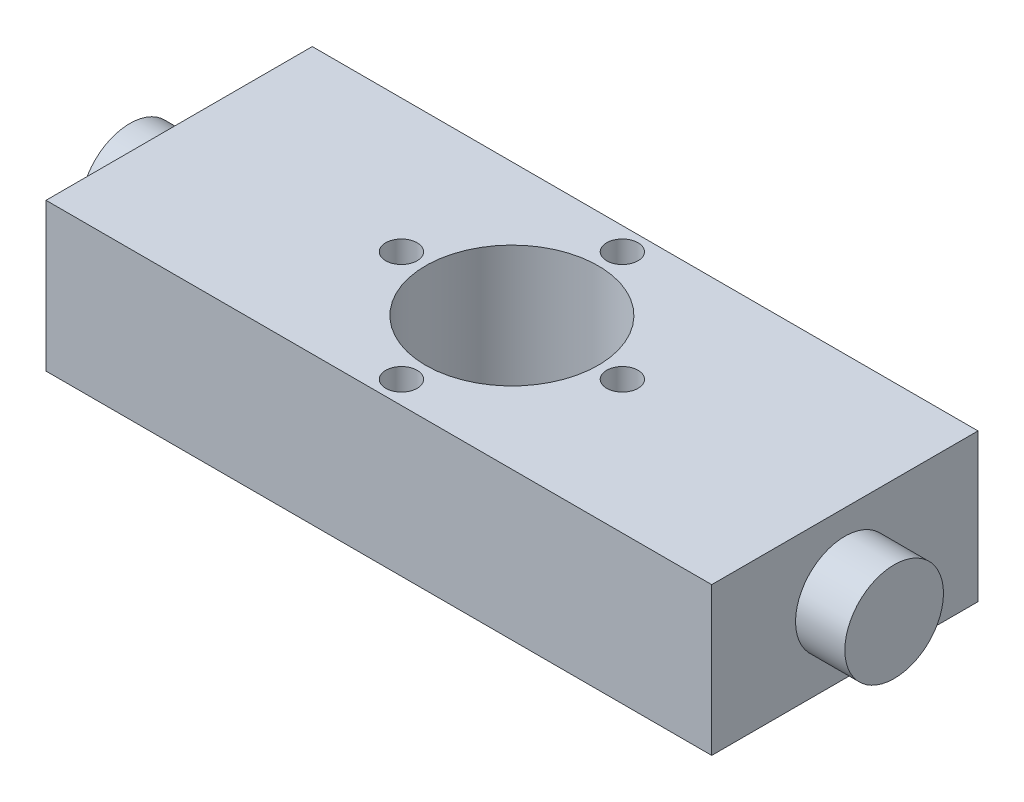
ISO-10303-21;
HEADER;
FILE_DESCRIPTION(('STEP AP214'),'2;1');
FILE_NAME('part.step','',(''),(''),'','','');
FILE_SCHEMA(('AUTOMOTIVE_DESIGN { 1 0 10303 214 1 1 1 1 }'));
ENDSEC;
DATA;
#1=APPLICATION_CONTEXT('core data for automotive mechanical design processes');
#2=APPLICATION_PROTOCOL_DEFINITION('international standard','automotive_design',2000,#1);
#3=PRODUCT_CONTEXT('',#1,'mechanical');
#4=PRODUCT('Part','Part','',(#3));
#5=PRODUCT_RELATED_PRODUCT_CATEGORY('part','',(#4));
#6=PRODUCT_DEFINITION_FORMATION('','',#4);
#7=PRODUCT_DEFINITION_CONTEXT('part definition',#1,'design');
#8=PRODUCT_DEFINITION('design','',#6,#7);
#9=PRODUCT_DEFINITION_SHAPE('','',#8);
#10=(LENGTH_UNIT() NAMED_UNIT(*) SI_UNIT(.MILLI.,.METRE.));
#11=(NAMED_UNIT(*) PLANE_ANGLE_UNIT() SI_UNIT($,.RADIAN.));
#12=(NAMED_UNIT(*) SI_UNIT($,.STERADIAN.) SOLID_ANGLE_UNIT());
#13=UNCERTAINTY_MEASURE_WITH_UNIT(LENGTH_MEASURE(1.E-05),#10,'distance_accuracy_value','');
#14=(GEOMETRIC_REPRESENTATION_CONTEXT(3) GLOBAL_UNCERTAINTY_ASSIGNED_CONTEXT((#13)) GLOBAL_UNIT_ASSIGNED_CONTEXT((#10,
#11,#12)) REPRESENTATION_CONTEXT('',''));
#15=CARTESIAN_POINT('',(0.,0.,0.));
#16=DIRECTION('',(0.,0.,1.));
#17=DIRECTION('',(1.,0.,0.));
#18=AXIS2_PLACEMENT_3D('',#15,#16,#17);
#19=CARTESIAN_POINT('',(0.,19.05,0.));
#20=DIRECTION('',(1.,0.,0.));
#21=DIRECTION('',(0.,0.,-1.));
#22=AXIS2_PLACEMENT_3D('',#19,#20,#21);
#23=PLANE('',#22);
#24=DIRECTION('',(0.,0.,1.));
#25=VECTOR('',#24,1.);
#26=CARTESIAN_POINT('',(0.,0.,0.));
#27=LINE('',#26,#25);
#28=CARTESIAN_POINT('',(0.,0.,-34.29));
#29=VERTEX_POINT('',#28);
#30=CARTESIAN_POINT('',(0.,0.,0.));
#31=VERTEX_POINT('',#30);
#32=EDGE_CURVE('E136',#29,#31,#27,.T.);
#33=ORIENTED_EDGE('',*,*,#32,.T.);
#34=DIRECTION('',(0.,-1.,0.));
#35=VECTOR('',#34,1.);
#36=CARTESIAN_POINT('',(0.,19.05,0.));
#37=LINE('',#36,#35);
#38=CARTESIAN_POINT('',(0.,19.05,0.));
#39=VERTEX_POINT('',#38);
#40=EDGE_CURVE('E160',#39,#31,#37,.T.);
#41=ORIENTED_EDGE('',*,*,#40,.F.);
#42=DIRECTION('',(0.,0.,1.));
#43=VECTOR('',#42,1.);
#44=CARTESIAN_POINT('',(0.,19.05,0.));
#45=LINE('',#44,#43);
#46=CARTESIAN_POINT('',(0.,19.05,-34.29));
#47=VERTEX_POINT('',#46);
#48=EDGE_CURVE('E146',#47,#39,#45,.T.);
#49=ORIENTED_EDGE('',*,*,#48,.F.);
#50=DIRECTION('',(0.,-1.,0.));
#51=VECTOR('',#50,1.);
#52=CARTESIAN_POINT('',(0.,19.05,-34.29));
#53=LINE('',#52,#51);
#54=EDGE_CURVE('E152',#47,#29,#53,.T.);
#55=ORIENTED_EDGE('',*,*,#54,.T.);
#56=EDGE_LOOP('',(#33,#41,#49,#55));
#57=FACE_BOUND('',#56,.T.);
#58=CARTESIAN_POINT('',(0.,9.525,-17.145));
#59=DIRECTION('',(1.,0.,0.));
#60=DIRECTION('',(0.,0.,-1.));
#61=AXIS2_PLACEMENT_3D('',#58,#59,#60);
#62=CIRCLE('',#61,6.35);
#63=CARTESIAN_POINT('',(0.,9.525,-23.495));
#64=VERTEX_POINT('',#63);
#65=EDGE_CURVE('E11',#64,#64,#62,.F.);
#66=ORIENTED_EDGE('',*,*,#65,.F.);
#67=EDGE_LOOP('',(#66));
#68=FACE_BOUND('',#67,.T.);
#69=ADVANCED_FACE('F42',(#57,#68),#23,.F.);
#70=CARTESIAN_POINT('',(85.725,19.05,0.));
#71=DIRECTION('',(-1.,0.,0.));
#72=DIRECTION('',(0.,0.,1.));
#73=AXIS2_PLACEMENT_3D('',#70,#71,#72);
#74=PLANE('',#73);
#75=DIRECTION('',(0.,0.,-1.));
#76=VECTOR('',#75,1.);
#77=CARTESIAN_POINT('',(85.725,0.,0.));
#78=LINE('',#77,#76);
#79=CARTESIAN_POINT('',(85.725,0.,0.));
#80=VERTEX_POINT('',#79);
#81=CARTESIAN_POINT('',(85.725,0.,-34.29));
#82=VERTEX_POINT('',#81);
#83=EDGE_CURVE('E142',#80,#82,#78,.T.);
#84=ORIENTED_EDGE('',*,*,#83,.T.);
#85=DIRECTION('',(0.,-1.,0.));
#86=VECTOR('',#85,1.);
#87=CARTESIAN_POINT('',(85.725,19.05,-34.29));
#88=LINE('',#87,#86);
#89=CARTESIAN_POINT('',(85.725,19.05,-34.29));
#90=VERTEX_POINT('',#89);
#91=EDGE_CURVE('E155',#90,#82,#88,.T.);
#92=ORIENTED_EDGE('',*,*,#91,.F.);
#93=DIRECTION('',(0.,0.,-1.));
#94=VECTOR('',#93,1.);
#95=CARTESIAN_POINT('',(85.725,19.05,0.));
#96=LINE('',#95,#94);
#97=CARTESIAN_POINT('',(85.725,19.05,0.));
#98=VERTEX_POINT('',#97);
#99=EDGE_CURVE('E62',#98,#90,#96,.T.);
#100=ORIENTED_EDGE('',*,*,#99,.F.);
#101=DIRECTION('',(0.,-1.,0.));
#102=VECTOR('',#101,1.);
#103=CARTESIAN_POINT('',(85.725,19.05,0.));
#104=LINE('',#103,#102);
#105=EDGE_CURVE('E158',#98,#80,#104,.T.);
#106=ORIENTED_EDGE('',*,*,#105,.T.);
#107=EDGE_LOOP('',(#84,#92,#100,#106));
#108=FACE_BOUND('',#107,.T.);
#109=CARTESIAN_POINT('',(85.725,9.525,-17.145));
#110=DIRECTION('',(-1.,0.,0.));
#111=DIRECTION('',(0.,0.,1.));
#112=AXIS2_PLACEMENT_3D('',#109,#110,#111);
#113=CIRCLE('',#112,6.35);
#114=CARTESIAN_POINT('',(85.725,9.525,-10.795));
#115=VERTEX_POINT('',#114);
#116=EDGE_CURVE('E45',#115,#115,#113,.F.);
#117=ORIENTED_EDGE('',*,*,#116,.F.);
#118=EDGE_LOOP('',(#117));
#119=FACE_BOUND('',#118,.T.);
#120=ADVANCED_FACE('F169',(#108,#119),#74,.F.);
#121=CARTESIAN_POINT('',(0.,19.05,0.));
#122=DIRECTION('',(0.,0.,-1.));
#123=DIRECTION('',(-1.,0.,0.));
#124=AXIS2_PLACEMENT_3D('',#121,#122,#123);
#125=PLANE('',#124);
#126=DIRECTION('',(1.,0.,0.));
#127=VECTOR('',#126,1.);
#128=CARTESIAN_POINT('',(0.,0.,0.));
#129=LINE('',#128,#127);
#130=EDGE_CURVE('E140',#31,#80,#129,.T.);
#131=ORIENTED_EDGE('',*,*,#130,.T.);
#132=ORIENTED_EDGE('',*,*,#105,.F.);
#133=DIRECTION('',(1.,0.,0.));
#134=VECTOR('',#133,1.);
#135=CARTESIAN_POINT('',(0.,19.05,0.));
#136=LINE('',#135,#134);
#137=EDGE_CURVE('E148',#39,#98,#136,.T.);
#138=ORIENTED_EDGE('',*,*,#137,.F.);
#139=ORIENTED_EDGE('',*,*,#40,.T.);
#140=EDGE_LOOP('',(#131,#132,#138,#139));
#141=FACE_BOUND('',#140,.T.);
#142=ADVANCED_FACE('F171',(#141),#125,.F.);
#143=CARTESIAN_POINT('',(0.,19.05,-34.29));
#144=DIRECTION('',(0.,0.,1.));
#145=DIRECTION('',(1.,0.,0.));
#146=AXIS2_PLACEMENT_3D('',#143,#144,#145);
#147=PLANE('',#146);
#148=DIRECTION('',(-1.,0.,0.));
#149=VECTOR('',#148,1.);
#150=CARTESIAN_POINT('',(0.,0.,-34.29));
#151=LINE('',#150,#149);
#152=EDGE_CURVE('E144',#82,#29,#151,.T.);
#153=ORIENTED_EDGE('',*,*,#152,.T.);
#154=ORIENTED_EDGE('',*,*,#54,.F.);
#155=DIRECTION('',(-1.,0.,0.));
#156=VECTOR('',#155,1.);
#157=CARTESIAN_POINT('',(0.,19.05,-34.29));
#158=LINE('',#157,#156);
#159=EDGE_CURVE('E57',#90,#47,#158,.T.);
#160=ORIENTED_EDGE('',*,*,#159,.F.);
#161=ORIENTED_EDGE('',*,*,#91,.T.);
#162=EDGE_LOOP('',(#153,#154,#160,#161));
#163=FACE_BOUND('',#162,.T.);
#164=ADVANCED_FACE('F178',(#163),#147,.F.);
#165=CARTESIAN_POINT('',(0.,19.05,-34.29));
#166=DIRECTION('',(0.,-1.,0.));
#167=DIRECTION('',(0.,0.,-1.));
#168=AXIS2_PLACEMENT_3D('',#165,#166,#167);
#169=PLANE('',#168);
#170=CARTESIAN_POINT('',(28.6258,19.05,-17.1449999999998));
#171=DIRECTION('',(0.,1.,0.));
#172=DIRECTION('',(0.,0.,1.));
#173=AXIS2_PLACEMENT_3D('',#170,#171,#172);
#174=CIRCLE('',#173,2.0193);
#175=CARTESIAN_POINT('',(28.6258,19.05,-15.1256999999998));
#176=VERTEX_POINT('',#175);
#177=EDGE_CURVE('E102',#176,#176,#174,.T.);
#178=ORIENTED_EDGE('',*,*,#177,.F.);
#179=EDGE_LOOP('',(#178));
#180=FACE_BOUND('',#179,.T.);
#181=CARTESIAN_POINT('',(42.8497999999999,19.05,-31.369));
#182=DIRECTION('',(0.,1.,0.));
#183=DIRECTION('',(0.,0.,1.));
#184=AXIS2_PLACEMENT_3D('',#181,#182,#183);
#185=CIRCLE('',#184,2.0193);
#186=CARTESIAN_POINT('',(42.8497999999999,19.05,-29.3497));
#187=VERTEX_POINT('',#186);
#188=EDGE_CURVE('E110',#187,#187,#185,.T.);
#189=ORIENTED_EDGE('',*,*,#188,.F.);
#190=EDGE_LOOP('',(#189));
#191=FACE_BOUND('',#190,.T.);
#192=CARTESIAN_POINT('',(57.0738,19.05,-17.1450000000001));
#193=DIRECTION('',(0.,1.,0.));
#194=DIRECTION('',(0.,0.,1.));
#195=AXIS2_PLACEMENT_3D('',#192,#193,#194);
#196=CIRCLE('',#195,2.01929999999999);
#197=CARTESIAN_POINT('',(57.0738,19.05,-15.1257000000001));
#198=VERTEX_POINT('',#197);
#199=EDGE_CURVE('E116',#198,#198,#196,.T.);
#200=ORIENTED_EDGE('',*,*,#199,.F.);
#201=EDGE_LOOP('',(#200));
#202=FACE_BOUND('',#201,.T.);
#203=CARTESIAN_POINT('',(42.8498,19.05,-2.921));
#204=DIRECTION('',(0.,1.,0.));
#205=DIRECTION('',(0.,0.,1.));
#206=AXIS2_PLACEMENT_3D('',#203,#204,#205);
#207=CIRCLE('',#206,2.01929999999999);
#208=CARTESIAN_POINT('',(42.8498,19.05,-0.901700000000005));
#209=VERTEX_POINT('',#208);
#210=EDGE_CURVE('E122',#209,#209,#207,.T.);
#211=ORIENTED_EDGE('',*,*,#210,.F.);
#212=EDGE_LOOP('',(#211));
#213=FACE_BOUND('',#212,.T.);
#214=CARTESIAN_POINT('',(42.8498,19.05,-17.145));
#215=DIRECTION('',(0.,1.,0.));
#216=DIRECTION('',(0.,0.,1.));
#217=AXIS2_PLACEMENT_3D('',#214,#215,#216);
#218=CIRCLE('',#217,11.1125);
#219=CARTESIAN_POINT('',(42.8498,19.05,-6.0325));
#220=VERTEX_POINT('',#219);
#221=EDGE_CURVE('E125',#220,#220,#218,.T.);
#222=ORIENTED_EDGE('',*,*,#221,.F.);
#223=EDGE_LOOP('',(#222));
#224=FACE_BOUND('',#223,.T.);
#225=ORIENTED_EDGE('',*,*,#48,.T.);
#226=ORIENTED_EDGE('',*,*,#137,.T.);
#227=ORIENTED_EDGE('',*,*,#99,.T.);
#228=ORIENTED_EDGE('',*,*,#159,.T.);
#229=EDGE_LOOP('',(#225,#226,#227,#228));
#230=FACE_BOUND('',#229,.T.);
#231=ADVANCED_FACE('F183',(#180,#191,#202,#213,#224,#230),#169,.F.);
#232=CARTESIAN_POINT('',(0.,0.,-34.29));
#233=DIRECTION('',(0.,-1.,0.));
#234=DIRECTION('',(0.,0.,-1.));
#235=AXIS2_PLACEMENT_3D('',#232,#233,#234);
#236=PLANE('',#235);
#237=CARTESIAN_POINT('',(42.8498,0.,-17.145));
#238=DIRECTION('',(0.,1.,0.));
#239=DIRECTION('',(0.,0.,1.));
#240=AXIS2_PLACEMENT_3D('',#237,#238,#239);
#241=CIRCLE('',#240,11.1125);
#242=CARTESIAN_POINT('',(42.8498,0.,-6.0325));
#243=VERTEX_POINT('',#242);
#244=EDGE_CURVE('E128',#243,#243,#241,.T.);
#245=ORIENTED_EDGE('',*,*,#244,.T.);
#246=EDGE_LOOP('',(#245));
#247=FACE_BOUND('',#246,.T.);
#248=ORIENTED_EDGE('',*,*,#32,.F.);
#249=ORIENTED_EDGE('',*,*,#152,.F.);
#250=ORIENTED_EDGE('',*,*,#83,.F.);
#251=ORIENTED_EDGE('',*,*,#130,.F.);
#252=EDGE_LOOP('',(#248,#249,#250,#251));
#253=FACE_BOUND('',#252,.T.);
#254=ADVANCED_FACE('F187',(#247,#253),#236,.T.);
#255=CARTESIAN_POINT('',(92.075,9.525,-17.145));
#256=DIRECTION('',(1.,0.,0.));
#257=DIRECTION('',(0.,0.,-1.));
#258=AXIS2_PLACEMENT_3D('',#255,#256,#257);
#259=PLANE('',#258);
#260=CARTESIAN_POINT('',(92.075,9.525,-17.145));
#261=DIRECTION('',(1.,0.,0.));
#262=DIRECTION('',(0.,0.,-1.));
#263=AXIS2_PLACEMENT_3D('',#260,#261,#262);
#264=CIRCLE('',#263,6.35);
#265=CARTESIAN_POINT('',(92.075,9.525,-23.495));
#266=VERTEX_POINT('',#265);
#267=EDGE_CURVE('E134',#266,#266,#264,.T.);
#268=ORIENTED_EDGE('',*,*,#267,.T.);
#269=EDGE_LOOP('',(#268));
#270=FACE_BOUND('',#269,.T.);
#271=ADVANCED_FACE('F191',(#270),#259,.T.);
#272=CARTESIAN_POINT('',(92.075,9.525,-17.145));
#273=DIRECTION('',(-1.,0.,0.));
#274=DIRECTION('',(0.,0.,1.));
#275=AXIS2_PLACEMENT_3D('',#272,#273,#274);
#276=CYLINDRICAL_SURFACE('',#275,6.35);
#277=ORIENTED_EDGE('',*,*,#267,.F.);
#278=EDGE_LOOP('',(#277));
#279=FACE_BOUND('',#278,.T.);
#280=ORIENTED_EDGE('',*,*,#116,.T.);
#281=EDGE_LOOP('',(#280));
#282=FACE_BOUND('',#281,.T.);
#283=ADVANCED_FACE('F167',(#279,#282),#276,.T.);
#284=CARTESIAN_POINT('',(-6.35000000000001,9.525,-17.145));
#285=DIRECTION('',(1.,0.,0.));
#286=DIRECTION('',(0.,0.,-1.));
#287=AXIS2_PLACEMENT_3D('',#284,#285,#286);
#288=CIRCLE('',#287,6.35);
#289=CARTESIAN_POINT('',(-6.35000000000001,9.525,-23.495));
#290=VERTEX_POINT('',#289);
#291=EDGE_CURVE('E131',#290,#290,#288,.T.);
#292=ORIENTED_EDGE('',*,*,#291,.T.);
#293=EDGE_LOOP('',(#292));
#294=FACE_BOUND('',#293,.T.);
#295=ORIENTED_EDGE('',*,*,#65,.T.);
#296=EDGE_LOOP('',(#295));
#297=FACE_BOUND('',#296,.T.);
#298=ADVANCED_FACE('F193',(#294,#297),#276,.T.);
#299=CARTESIAN_POINT('',(-6.35000000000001,9.525,-17.145));
#300=DIRECTION('',(1.,0.,0.));
#301=DIRECTION('',(0.,0.,-1.));
#302=AXIS2_PLACEMENT_3D('',#299,#300,#301);
#303=PLANE('',#302);
#304=ORIENTED_EDGE('',*,*,#291,.F.);
#305=EDGE_LOOP('',(#304));
#306=FACE_BOUND('',#305,.T.);
#307=ADVANCED_FACE('F196',(#306),#303,.F.);
#308=CARTESIAN_POINT('',(42.8498,0.,-17.145));
#309=DIRECTION('',(0.,1.,0.));
#310=DIRECTION('',(0.,0.,1.));
#311=AXIS2_PLACEMENT_3D('',#308,#309,#310);
#312=CYLINDRICAL_SURFACE('',#311,11.1125);
#313=CARTESIAN_POINT('',(42.8498,0.,-6.0325));
#314=CARTESIAN_POINT('',(42.8498,0.1984375,-6.0325));
#315=CARTESIAN_POINT('',(42.8498,0.396875,-6.0325));
#316=CARTESIAN_POINT('',(42.8498,0.79375,-6.0325));
#317=CARTESIAN_POINT('',(42.8498,0.9921875,-6.0325));
#318=CARTESIAN_POINT('',(42.8498,1.3890625,-6.0325));
#319=CARTESIAN_POINT('',(42.8498,1.5875,-6.0325));
#320=CARTESIAN_POINT('',(42.8498,1.984375,-6.0325));
#321=CARTESIAN_POINT('',(42.8498,2.1828125,-6.0325));
#322=CARTESIAN_POINT('',(42.8498,2.5796875,-6.0325));
#323=CARTESIAN_POINT('',(42.8498,2.778125,-6.0325));
#324=CARTESIAN_POINT('',(42.8498,3.175,-6.0325));
#325=CARTESIAN_POINT('',(42.8498,3.3734375,-6.0325));
#326=CARTESIAN_POINT('',(42.8498,3.7703125,-6.0325));
#327=CARTESIAN_POINT('',(42.8498,3.96875,-6.0325));
#328=CARTESIAN_POINT('',(42.8498,4.365625,-6.0325));
#329=CARTESIAN_POINT('',(42.8498,4.5640625,-6.0325));
#330=CARTESIAN_POINT('',(42.8498,4.9609375,-6.0325));
#331=CARTESIAN_POINT('',(42.8498,5.159375,-6.0325));
#332=CARTESIAN_POINT('',(42.8498,5.55625,-6.0325));
#333=CARTESIAN_POINT('',(42.8498,5.7546875,-6.0325));
#334=CARTESIAN_POINT('',(42.8498,6.1515625,-6.0325));
#335=CARTESIAN_POINT('',(42.8498,6.35,-6.0325));
#336=CARTESIAN_POINT('',(42.8498,6.746875,-6.0325));
#337=CARTESIAN_POINT('',(42.8498,6.9453125,-6.0325));
#338=CARTESIAN_POINT('',(42.8498,7.3421875,-6.0325));
#339=CARTESIAN_POINT('',(42.8498,7.540625,-6.0325));
#340=CARTESIAN_POINT('',(42.8498,7.9375,-6.0325));
#341=CARTESIAN_POINT('',(42.8498,8.1359375,-6.0325));
#342=CARTESIAN_POINT('',(42.8498,8.5328125,-6.0325));
#343=CARTESIAN_POINT('',(42.8498,8.73125,-6.0325));
#344=CARTESIAN_POINT('',(42.8498,9.128125,-6.0325));
#345=CARTESIAN_POINT('',(42.8498,9.3265625,-6.0325));
#346=CARTESIAN_POINT('',(42.8498,9.7234375,-6.0325));
#347=CARTESIAN_POINT('',(42.8498,9.921875,-6.0325));
#348=CARTESIAN_POINT('',(42.8498,10.31875,-6.0325));
#349=CARTESIAN_POINT('',(42.8498,10.5171875,-6.0325));
#350=CARTESIAN_POINT('',(42.8498,10.9140625,-6.0325));
#351=CARTESIAN_POINT('',(42.8498,11.1125,-6.0325));
#352=CARTESIAN_POINT('',(42.8498,11.509375,-6.0325));
#353=CARTESIAN_POINT('',(42.8498,11.7078125,-6.0325));
#354=CARTESIAN_POINT('',(42.8498,12.1046875,-6.0325));
#355=CARTESIAN_POINT('',(42.8498,12.303125,-6.0325));
#356=CARTESIAN_POINT('',(42.8498,12.7,-6.0325));
#357=CARTESIAN_POINT('',(42.8498,12.8984375,-6.0325));
#358=CARTESIAN_POINT('',(42.8498,13.2953125,-6.0325));
#359=CARTESIAN_POINT('',(42.8498,13.49375,-6.0325));
#360=CARTESIAN_POINT('',(42.8498,13.890625,-6.0325));
#361=CARTESIAN_POINT('',(42.8498,14.0890625,-6.0325));
#362=CARTESIAN_POINT('',(42.8498,14.4859375,-6.0325));
#363=CARTESIAN_POINT('',(42.8498,14.684375,-6.0325));
#364=CARTESIAN_POINT('',(42.8498,15.08125,-6.0325));
#365=CARTESIAN_POINT('',(42.8498,15.2796875,-6.0325));
#366=CARTESIAN_POINT('',(42.8498,15.6765625,-6.0325));
#367=CARTESIAN_POINT('',(42.8498,15.875,-6.0325));
#368=CARTESIAN_POINT('',(42.8498,16.271875,-6.0325));
#369=CARTESIAN_POINT('',(42.8498,16.4703125,-6.0325));
#370=CARTESIAN_POINT('',(42.8498,16.8671875,-6.0325));
#371=CARTESIAN_POINT('',(42.8498,17.065625,-6.0325));
#372=CARTESIAN_POINT('',(42.8498,17.4625,-6.0325));
#373=CARTESIAN_POINT('',(42.8498,17.6609375,-6.0325));
#374=CARTESIAN_POINT('',(42.8498,18.0578125,-6.0325));
#375=CARTESIAN_POINT('',(42.8498,18.25625,-6.0325));
#376=CARTESIAN_POINT('',(42.8498,18.653125,-6.0325));
#377=CARTESIAN_POINT('',(42.8498,18.8515625,-6.0325));
#378=CARTESIAN_POINT('',(42.8498,19.05,-6.0325));
#379=B_SPLINE_CURVE_WITH_KNOTS('',3,(#313,#314,#315,#316,#317,#318,#319,#320,#321,#322,#323,
#324,#325,#326,#327,#328,#329,#330,#331,#332,#333,#334,#335,#336,#337,#338,#339,#340,#341,#342,
#343,#344,#345,#346,#347,#348,#349,#350,#351,#352,#353,#354,#355,#356,#357,#358,#359,#360,#361,
#362,#363,#364,#365,#366,#367,#368,#369,#370,#371,#372,#373,#374,#375,#376,#377,#378),
.UNSPECIFIED.,.F.,.F.,(4,2,2,2,2,2,2,2,2,2,2,2,2,2,2,2,2,2,2,2,2,2,2,2,2,2,2,2,2,2,2,2,4),(0.,
0.5953125,1.190625,1.7859375,2.38125,2.9765625,3.571875,4.1671875,4.7625,5.3578125,5.953125,
6.5484375,7.14375,7.7390625,8.334375,8.9296875,9.525,10.1203125,10.715625,11.3109375,11.90625,
12.5015625,13.096875,13.6921875,14.2875,14.8828125,15.478125,16.0734375,16.66875,17.2640625,
17.859375,18.4546875,19.05),.UNSPECIFIED.);
#380=EDGE_CURVE('BSEAM203',#243,#220,#379,.T.);
#381=ORIENTED_EDGE('',*,*,#244,.F.);
#382=ORIENTED_EDGE('',*,*,#221,.T.);
#383=ORIENTED_EDGE('',*,*,#380,.T.);
#384=ORIENTED_EDGE('',*,*,#380,.F.);
#385=EDGE_LOOP('',(#381,#383,#382,#384));
#386=FACE_BOUND('',#385,.T.);
#387=ADVANCED_FACE('F203',(#386),#312,.F.);
#388=CARTESIAN_POINT('',(42.8498,19.05,-2.921));
#389=DIRECTION('',(0.,1.,0.));
#390=DIRECTION('',(0.,0.,1.));
#391=AXIS2_PLACEMENT_3D('',#388,#389,#390);
#392=CYLINDRICAL_SURFACE('',#391,2.01929999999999);
#393=CARTESIAN_POINT('',(42.8498,5.334,-2.921));
#394=DIRECTION('',(0.,1.,0.));
#395=DIRECTION('',(0.,0.,1.));
#396=AXIS2_PLACEMENT_3D('',#393,#394,#395);
#397=CIRCLE('',#396,2.01929999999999);
#398=CARTESIAN_POINT('',(42.8498,5.334,-0.901700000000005));
#399=VERTEX_POINT('',#398);
#400=EDGE_CURVE('E119',#399,#399,#397,.T.);
#401=ORIENTED_EDGE('',*,*,#400,.F.);
#402=EDGE_LOOP('',(#401));
#403=FACE_BOUND('',#402,.T.);
#404=ORIENTED_EDGE('',*,*,#210,.T.);
#405=EDGE_LOOP('',(#404));
#406=FACE_BOUND('',#405,.T.);
#407=ADVANCED_FACE('F207',(#403,#406),#392,.F.);
#408=CARTESIAN_POINT('',(42.8498,5.334,-2.921));
#409=DIRECTION('',(0.,1.,0.));
#410=DIRECTION('',(0.,0.,1.));
#411=AXIS2_PLACEMENT_3D('',#408,#409,#410);
#412=CONICAL_SURFACE('',#411,2.01929999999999,1.02974425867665);
#413=CARTESIAN_POINT('',(42.8498,4.12068215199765,-2.921));
#414=VERTEX_POINT('',#413);
#415=VERTEX_LOOP('',#414);
#416=FACE_BOUND('',#415,.T.);
#417=ORIENTED_EDGE('',*,*,#400,.T.);
#418=EDGE_LOOP('',(#417));
#419=FACE_BOUND('',#418,.T.);
#420=ADVANCED_FACE('F211',(#416,#419),#412,.F.);
#421=CARTESIAN_POINT('',(57.0738,19.05,-17.1450000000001));
#422=DIRECTION('',(0.,1.,0.));
#423=DIRECTION('',(0.,0.,1.));
#424=AXIS2_PLACEMENT_3D('',#421,#422,#423);
#425=CYLINDRICAL_SURFACE('',#424,2.01929999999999);
#426=CARTESIAN_POINT('',(57.0738,5.334,-17.1450000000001));
#427=DIRECTION('',(0.,1.,0.));
#428=DIRECTION('',(0.,0.,1.));
#429=AXIS2_PLACEMENT_3D('',#426,#427,#428);
#430=CIRCLE('',#429,2.01929999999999);
#431=CARTESIAN_POINT('',(57.0738,5.334,-15.1257000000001));
#432=VERTEX_POINT('',#431);
#433=EDGE_CURVE('E113',#432,#432,#430,.T.);
#434=ORIENTED_EDGE('',*,*,#433,.F.);
#435=EDGE_LOOP('',(#434));
#436=FACE_BOUND('',#435,.T.);
#437=ORIENTED_EDGE('',*,*,#199,.T.);
#438=EDGE_LOOP('',(#437));
#439=FACE_BOUND('',#438,.T.);
#440=ADVANCED_FACE('F215',(#436,#439),#425,.F.);
#441=CARTESIAN_POINT('',(57.0738,5.334,-17.1450000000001));
#442=DIRECTION('',(0.,1.,0.));
#443=DIRECTION('',(0.,0.,1.));
#444=AXIS2_PLACEMENT_3D('',#441,#442,#443);
#445=CONICAL_SURFACE('',#444,2.01929999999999,1.02974425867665);
#446=CARTESIAN_POINT('',(57.0738,4.12068215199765,-17.1450000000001));
#447=VERTEX_POINT('',#446);
#448=VERTEX_LOOP('',#447);
#449=FACE_BOUND('',#448,.T.);
#450=ORIENTED_EDGE('',*,*,#433,.T.);
#451=EDGE_LOOP('',(#450));
#452=FACE_BOUND('',#451,.T.);
#453=ADVANCED_FACE('F219',(#449,#452),#445,.F.);
#454=CARTESIAN_POINT('',(42.8497999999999,19.05,-31.369));
#455=DIRECTION('',(0.,1.,0.));
#456=DIRECTION('',(0.,0.,1.));
#457=AXIS2_PLACEMENT_3D('',#454,#455,#456);
#458=CYLINDRICAL_SURFACE('',#457,2.0193);
#459=CARTESIAN_POINT('',(42.8497999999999,5.334,-31.369));
#460=DIRECTION('',(0.,1.,0.));
#461=DIRECTION('',(0.,0.,1.));
#462=AXIS2_PLACEMENT_3D('',#459,#460,#461);
#463=CIRCLE('',#462,2.01929999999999);
#464=CARTESIAN_POINT('',(42.8497999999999,5.334,-29.3497));
#465=VERTEX_POINT('',#464);
#466=EDGE_CURVE('E105',#465,#465,#463,.T.);
#467=ORIENTED_EDGE('',*,*,#466,.F.);
#468=EDGE_LOOP('',(#467));
#469=FACE_BOUND('',#468,.T.);
#470=ORIENTED_EDGE('',*,*,#188,.T.);
#471=EDGE_LOOP('',(#470));
#472=FACE_BOUND('',#471,.T.);
#473=ADVANCED_FACE('F223',(#469,#472),#458,.F.);
#474=CARTESIAN_POINT('',(42.8497999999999,5.334,-31.369));
#475=DIRECTION('',(0.,1.,0.));
#476=DIRECTION('',(0.,0.,1.));
#477=AXIS2_PLACEMENT_3D('',#474,#475,#476);
#478=CONICAL_SURFACE('',#477,2.01929999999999,1.02974425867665);
#479=CARTESIAN_POINT('',(42.8497999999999,4.12068215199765,-31.369));
#480=VERTEX_POINT('',#479);
#481=VERTEX_LOOP('',#480);
#482=FACE_BOUND('',#481,.T.);
#483=ORIENTED_EDGE('',*,*,#466,.T.);
#484=EDGE_LOOP('',(#483));
#485=FACE_BOUND('',#484,.T.);
#486=ADVANCED_FACE('F227',(#482,#485),#478,.F.);
#487=CARTESIAN_POINT('',(28.6258,19.05,-17.1449999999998));
#488=DIRECTION('',(0.,1.,0.));
#489=DIRECTION('',(0.,0.,1.));
#490=AXIS2_PLACEMENT_3D('',#487,#488,#489);
#491=CYLINDRICAL_SURFACE('',#490,2.0193);
#492=CARTESIAN_POINT('',(28.6258,5.334,-17.1449999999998));
#493=DIRECTION('',(0.,1.,0.));
#494=DIRECTION('',(0.,0.,1.));
#495=AXIS2_PLACEMENT_3D('',#492,#493,#494);
#496=CIRCLE('',#495,2.01929999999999);
#497=CARTESIAN_POINT('',(28.6258,5.334,-15.1256999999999));
#498=VERTEX_POINT('',#497);
#499=EDGE_CURVE('E100',#498,#498,#496,.T.);
#500=ORIENTED_EDGE('',*,*,#499,.F.);
#501=EDGE_LOOP('',(#500));
#502=FACE_BOUND('',#501,.T.);
#503=ORIENTED_EDGE('',*,*,#177,.T.);
#504=EDGE_LOOP('',(#503));
#505=FACE_BOUND('',#504,.T.);
#506=ADVANCED_FACE('F96',(#502,#505),#491,.F.);
#507=CARTESIAN_POINT('',(28.6258,5.334,-17.1449999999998));
#508=DIRECTION('',(0.,1.,0.));
#509=DIRECTION('',(0.,0.,1.));
#510=AXIS2_PLACEMENT_3D('',#507,#508,#509);
#511=CONICAL_SURFACE('',#510,2.01929999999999,1.02974425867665);
#512=CARTESIAN_POINT('',(28.6258,4.12068215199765,-17.1449999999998));
#513=VERTEX_POINT('',#512);
#514=VERTEX_LOOP('',#513);
#515=FACE_BOUND('',#514,.T.);
#516=ORIENTED_EDGE('',*,*,#499,.T.);
#517=EDGE_LOOP('',(#516));
#518=FACE_BOUND('',#517,.T.);
#519=ADVANCED_FACE('F93',(#515,#518),#511,.F.);
#520=CLOSED_SHELL('',(#69,#120,#142,#164,#231,#254,#271,#283,#298,#307,#387,#407,#420,#440,#453,
#473,#486,#506,#519));
#521=MANIFOLD_SOLID_BREP('B2',#520);
#522=ADVANCED_BREP_SHAPE_REPRESENTATION('',(#18,#521),#14);
#523=SHAPE_DEFINITION_REPRESENTATION(#9,#522);
ENDSEC;
END-ISO-10303-21;
